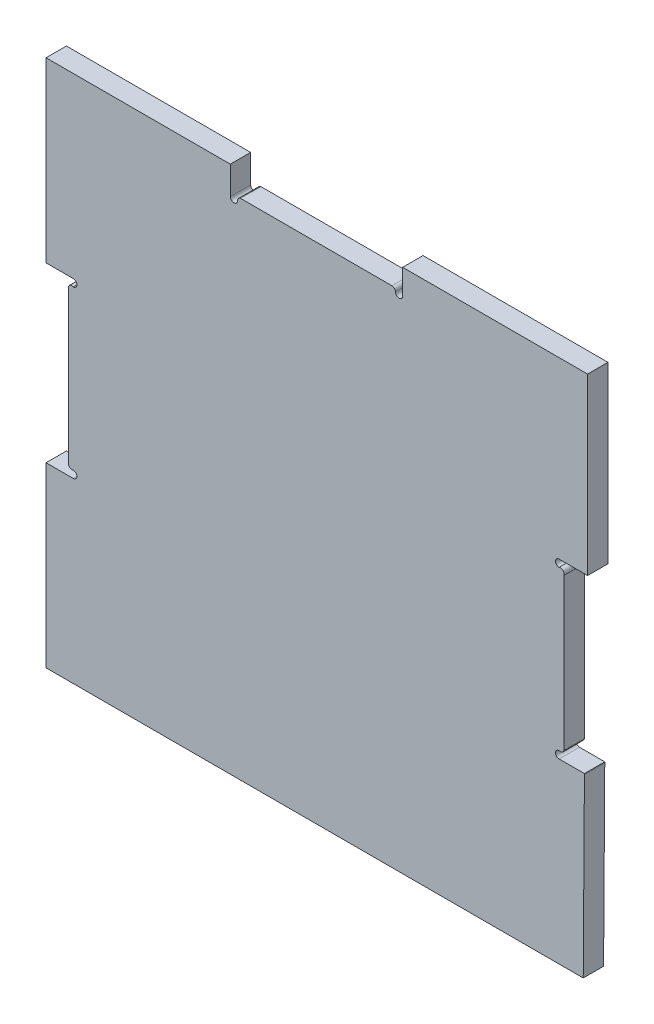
ISO-10303-21;
HEADER;
FILE_DESCRIPTION(('STEP AP214'),'2;1');
FILE_NAME('part.step','',(''),(''),'','','');
FILE_SCHEMA(('AUTOMOTIVE_DESIGN { 1 0 10303 214 1 1 1 1 }'));
ENDSEC;
DATA;
#1=APPLICATION_CONTEXT('core data for automotive mechanical design processes');
#2=APPLICATION_PROTOCOL_DEFINITION('international standard','automotive_design',2000,#1);
#3=PRODUCT_CONTEXT('',#1,'mechanical');
#4=PRODUCT('Part','Part','',(#3));
#5=PRODUCT_RELATED_PRODUCT_CATEGORY('part','',(#4));
#6=PRODUCT_DEFINITION_FORMATION('','',#4);
#7=PRODUCT_DEFINITION_CONTEXT('part definition',#1,'design');
#8=PRODUCT_DEFINITION('design','',#6,#7);
#9=PRODUCT_DEFINITION_SHAPE('','',#8);
#10=(LENGTH_UNIT() NAMED_UNIT(*) SI_UNIT(.MILLI.,.METRE.));
#11=(NAMED_UNIT(*) PLANE_ANGLE_UNIT() SI_UNIT($,.RADIAN.));
#12=(NAMED_UNIT(*) SI_UNIT($,.STERADIAN.) SOLID_ANGLE_UNIT());
#13=UNCERTAINTY_MEASURE_WITH_UNIT(LENGTH_MEASURE(1.E-05),#10,'distance_accuracy_value','');
#14=(GEOMETRIC_REPRESENTATION_CONTEXT(3) GLOBAL_UNCERTAINTY_ASSIGNED_CONTEXT((#13)) GLOBAL_UNIT_ASSIGNED_CONTEXT((#10,
#11,#12)) REPRESENTATION_CONTEXT('',''));
#15=CARTESIAN_POINT('',(0.,0.,0.));
#16=DIRECTION('',(0.,0.,1.));
#17=DIRECTION('',(1.,0.,0.));
#18=AXIS2_PLACEMENT_3D('',#15,#16,#17);
#19=CARTESIAN_POINT('',(204.950295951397,1.47353347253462,17.));
#20=DIRECTION('',(-1.,0.,0.));
#21=DIRECTION('',(0.,0.,1.));
#22=AXIS2_PLACEMENT_3D('',#19,#20,#21);
#23=PLANE('',#22);
#24=DIRECTION('',(0.,1.,0.));
#25=VECTOR('',#24,1.);
#26=CARTESIAN_POINT('',(204.950295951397,1.47353347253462,0.));
#27=LINE('',#26,#25);
#28=CARTESIAN_POINT('',(204.950295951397,1.47353347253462,0.));
#29=VERTEX_POINT('',#28);
#30=CARTESIAN_POINT('',(204.950295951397,2.27000204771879,0.));
#31=VERTEX_POINT('',#30);
#32=EDGE_CURVE('E255',#29,#31,#27,.T.);
#33=ORIENTED_EDGE('',*,*,#32,.T.);
#34=DIRECTION('',(0.,0.,-1.));
#35=VECTOR('',#34,1.);
#36=CARTESIAN_POINT('',(204.950295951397,2.27000204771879,17.));
#37=LINE('',#36,#35);
#38=CARTESIAN_POINT('',(204.950295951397,2.27000204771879,17.));
#39=VERTEX_POINT('',#38);
#40=EDGE_CURVE('E11',#39,#31,#37,.T.);
#41=ORIENTED_EDGE('',*,*,#40,.F.);
#42=DIRECTION('',(0.,1.,0.));
#43=VECTOR('',#42,1.);
#44=CARTESIAN_POINT('',(204.950295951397,1.47353347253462,17.));
#45=LINE('',#44,#43);
#46=CARTESIAN_POINT('',(204.950295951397,1.47353347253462,17.));
#47=VERTEX_POINT('',#46);
#48=EDGE_CURVE('E312',#47,#39,#45,.T.);
#49=ORIENTED_EDGE('',*,*,#48,.F.);
#50=DIRECTION('',(0.,0.,-1.));
#51=VECTOR('',#50,1.);
#52=CARTESIAN_POINT('',(204.950295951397,1.47353347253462,17.));
#53=LINE('',#52,#51);
#54=EDGE_CURVE('E251',#47,#29,#53,.T.);
#55=ORIENTED_EDGE('',*,*,#54,.T.);
#56=EDGE_LOOP('',(#33,#41,#49,#55));
#57=FACE_BOUND('',#56,.T.);
#58=ADVANCED_FACE('F33',(#57),#23,.F.);
#59=CARTESIAN_POINT('',(183.801380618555,2.27000204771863,17.));
#60=DIRECTION('',(0.,-1.,0.));
#61=DIRECTION('',(1.,0.,0.));
#62=AXIS2_PLACEMENT_3D('',#59,#60,#61);
#63=PLANE('',#62);
#64=DIRECTION('',(-1.,0.,0.));
#65=VECTOR('',#64,1.);
#66=CARTESIAN_POINT('',(183.801380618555,2.27000204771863,0.));
#67=LINE('',#66,#65);
#68=CARTESIAN_POINT('',(183.801380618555,2.27000204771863,0.));
#69=VERTEX_POINT('',#68);
#70=EDGE_CURVE('E258',#31,#69,#67,.T.);
#71=ORIENTED_EDGE('',*,*,#70,.T.);
#72=DIRECTION('',(0.,0.,-1.));
#73=VECTOR('',#72,1.);
#74=CARTESIAN_POINT('',(183.801380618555,2.27000204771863,17.));
#75=LINE('',#74,#73);
#76=CARTESIAN_POINT('',(183.801380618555,2.27000204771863,17.));
#77=VERTEX_POINT('',#76);
#78=EDGE_CURVE('E41',#77,#69,#75,.T.);
#79=ORIENTED_EDGE('',*,*,#78,.F.);
#80=DIRECTION('',(-1.,0.,0.));
#81=VECTOR('',#80,1.);
#82=CARTESIAN_POINT('',(183.801380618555,2.27000204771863,17.));
#83=LINE('',#82,#81);
#84=EDGE_CURVE('E155',#39,#77,#83,.T.);
#85=ORIENTED_EDGE('',*,*,#84,.F.);
#86=ORIENTED_EDGE('',*,*,#40,.T.);
#87=EDGE_LOOP('',(#71,#79,#85,#86));
#88=FACE_BOUND('',#87,.T.);
#89=ADVANCED_FACE('F475',(#88),#63,.F.);
#90=CARTESIAN_POINT('',(183.801380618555,5.27000204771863,17.));
#91=DIRECTION('',(0.,0.,-1.));
#92=DIRECTION('',(-1.,0.,0.));
#93=AXIS2_PLACEMENT_3D('',#90,#91,#92);
#94=CYLINDRICAL_SURFACE('',#93,3.);
#95=CARTESIAN_POINT('',(183.801380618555,5.27000204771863,0.));
#96=DIRECTION('',(0.,0.,-1.));
#97=DIRECTION('',(-1.,0.,0.));
#98=AXIS2_PLACEMENT_3D('',#95,#96,#97);
#99=CIRCLE('',#98,3.);
#100=CARTESIAN_POINT('',(183.801380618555,8.27000204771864,0.));
#101=VERTEX_POINT('',#100);
#102=EDGE_CURVE('E260',#69,#101,#99,.T.);
#103=ORIENTED_EDGE('',*,*,#102,.T.);
#104=DIRECTION('',(0.,0.,-1.));
#105=VECTOR('',#104,1.);
#106=CARTESIAN_POINT('',(183.801380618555,8.27000204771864,17.));
#107=LINE('',#106,#105);
#108=CARTESIAN_POINT('',(183.801380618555,8.27000204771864,17.));
#109=VERTEX_POINT('',#108);
#110=EDGE_CURVE('E382',#109,#101,#107,.T.);
#111=ORIENTED_EDGE('',*,*,#110,.F.);
#112=CARTESIAN_POINT('',(183.801380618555,5.27000204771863,17.));
#113=DIRECTION('',(0.,0.,-1.));
#114=DIRECTION('',(-1.,0.,0.));
#115=AXIS2_PLACEMENT_3D('',#112,#113,#114);
#116=CIRCLE('',#115,3.);
#117=EDGE_CURVE('E390',#77,#109,#116,.T.);
#118=ORIENTED_EDGE('',*,*,#117,.F.);
#119=ORIENTED_EDGE('',*,*,#78,.T.);
#120=EDGE_LOOP('',(#103,#111,#118,#119));
#121=FACE_BOUND('',#120,.T.);
#122=ADVANCED_FACE('F388',(#121),#94,.F.);
#123=CARTESIAN_POINT('',(184.900704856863,11.0613254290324,17.));
#124=DIRECTION('',(0.,0.,-1.));
#125=DIRECTION('',(-1.,0.,0.));
#126=AXIS2_PLACEMENT_3D('',#123,#124,#125);
#127=CYLINDRICAL_SURFACE('',#126,3.00000000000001);
#128=CARTESIAN_POINT('',(184.900704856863,11.0613254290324,0.));
#129=DIRECTION('',(0.,0.,1.));
#130=DIRECTION('',(-1.,0.,0.));
#131=AXIS2_PLACEMENT_3D('',#128,#129,#130);
#132=CIRCLE('',#131,3.00000000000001);
#133=CARTESIAN_POINT('',(187.855837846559,10.5444221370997,0.));
#134=VERTEX_POINT('',#133);
#135=EDGE_CURVE('E262',#101,#134,#132,.T.);
#136=ORIENTED_EDGE('',*,*,#135,.T.);
#137=DIRECTION('',(0.,0.,-1.));
#138=VECTOR('',#137,1.);
#139=CARTESIAN_POINT('',(187.855837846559,10.5444221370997,17.));
#140=LINE('',#139,#138);
#141=CARTESIAN_POINT('',(187.855837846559,10.5444221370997,17.));
#142=VERTEX_POINT('',#141);
#143=EDGE_CURVE('E379',#142,#134,#140,.T.);
#144=ORIENTED_EDGE('',*,*,#143,.F.);
#145=CARTESIAN_POINT('',(184.900704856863,11.0613254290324,17.));
#146=DIRECTION('',(0.,0.,1.));
#147=DIRECTION('',(-1.,0.,0.));
#148=AXIS2_PLACEMENT_3D('',#145,#146,#147);
#149=CIRCLE('',#148,3.00000000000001);
#150=EDGE_CURVE('E408',#109,#142,#149,.T.);
#151=ORIENTED_EDGE('',*,*,#150,.F.);
#152=ORIENTED_EDGE('',*,*,#110,.T.);
#153=EDGE_LOOP('',(#136,#144,#151,#152));
#154=FACE_BOUND('',#153,.T.);
#155=ADVANCED_FACE('F399',(#154),#127,.T.);
#156=CARTESIAN_POINT('',(187.855837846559,137.104422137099,17.));
#157=DIRECTION('',(-1.,0.,0.));
#158=DIRECTION('',(0.,-1.,0.));
#159=AXIS2_PLACEMENT_3D('',#156,#157,#158);
#160=PLANE('',#159);
#161=DIRECTION('',(0.,1.,0.));
#162=VECTOR('',#161,1.);
#163=CARTESIAN_POINT('',(187.855837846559,137.104422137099,0.));
#164=LINE('',#163,#162);
#165=CARTESIAN_POINT('',(187.855837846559,137.104422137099,0.));
#166=VERTEX_POINT('',#165);
#167=EDGE_CURVE('E264',#134,#166,#164,.T.);
#168=ORIENTED_EDGE('',*,*,#167,.T.);
#169=DIRECTION('',(0.,0.,-1.));
#170=VECTOR('',#169,1.);
#171=CARTESIAN_POINT('',(187.855837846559,137.104422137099,17.));
#172=LINE('',#171,#170);
#173=CARTESIAN_POINT('',(187.855837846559,137.104422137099,17.));
#174=VERTEX_POINT('',#173);
#175=EDGE_CURVE('E376',#174,#166,#172,.T.);
#176=ORIENTED_EDGE('',*,*,#175,.F.);
#177=DIRECTION('',(0.,1.,0.));
#178=VECTOR('',#177,1.);
#179=CARTESIAN_POINT('',(187.855837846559,137.104422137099,17.));
#180=LINE('',#179,#178);
#181=EDGE_CURVE('E405',#142,#174,#180,.T.);
#182=ORIENTED_EDGE('',*,*,#181,.F.);
#183=ORIENTED_EDGE('',*,*,#143,.T.);
#184=EDGE_LOOP('',(#168,#176,#182,#183));
#185=FACE_BOUND('',#184,.T.);
#186=ADVANCED_FACE('F403',(#185),#160,.F.);
#187=CARTESIAN_POINT('',(185.022231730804,138.089651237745,17.));
#188=DIRECTION('',(0.,0.,-1.));
#189=DIRECTION('',(-1.,0.,0.));
#190=AXIS2_PLACEMENT_3D('',#187,#188,#189);
#191=CYLINDRICAL_SURFACE('',#190,3.);
#192=CARTESIAN_POINT('',(185.022231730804,138.089651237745,0.));
#193=DIRECTION('',(0.,0.,1.));
#194=DIRECTION('',(-1.,0.,0.));
#195=AXIS2_PLACEMENT_3D('',#192,#193,#194);
#196=CIRCLE('',#195,3.);
#197=CARTESIAN_POINT('',(183.801380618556,140.830002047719,0.));
#198=VERTEX_POINT('',#197);
#199=EDGE_CURVE('E266',#166,#198,#196,.T.);
#200=ORIENTED_EDGE('',*,*,#199,.T.);
#201=DIRECTION('',(0.,0.,-1.));
#202=VECTOR('',#201,1.);
#203=CARTESIAN_POINT('',(183.801380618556,140.830002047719,17.));
#204=LINE('',#203,#202);
#205=CARTESIAN_POINT('',(183.801380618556,140.830002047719,17.));
#206=VERTEX_POINT('',#205);
#207=EDGE_CURVE('E373',#206,#198,#204,.T.);
#208=ORIENTED_EDGE('',*,*,#207,.F.);
#209=CARTESIAN_POINT('',(185.022231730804,138.089651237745,17.));
#210=DIRECTION('',(0.,0.,1.));
#211=DIRECTION('',(-1.,0.,0.));
#212=AXIS2_PLACEMENT_3D('',#209,#210,#211);
#213=CIRCLE('',#212,3.);
#214=EDGE_CURVE('E407',#174,#206,#213,.T.);
#215=ORIENTED_EDGE('',*,*,#214,.F.);
#216=ORIENTED_EDGE('',*,*,#175,.T.);
#217=EDGE_LOOP('',(#200,#208,#215,#216));
#218=FACE_BOUND('',#217,.T.);
#219=ADVANCED_FACE('F488',(#218),#191,.T.);
#220=CARTESIAN_POINT('',(183.801380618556,143.830002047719,17.));
#221=DIRECTION('',(0.,0.,-1.));
#222=DIRECTION('',(-1.,0.,0.));
#223=AXIS2_PLACEMENT_3D('',#220,#221,#222);
#224=CYLINDRICAL_SURFACE('',#223,3.);
#225=CARTESIAN_POINT('',(183.801380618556,143.830002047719,0.));
#226=DIRECTION('',(0.,0.,-1.));
#227=DIRECTION('',(-1.,0.,0.));
#228=AXIS2_PLACEMENT_3D('',#225,#226,#227);
#229=CIRCLE('',#228,3.);
#230=CARTESIAN_POINT('',(183.801380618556,146.830002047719,0.));
#231=VERTEX_POINT('',#230);
#232=EDGE_CURVE('E268',#198,#231,#229,.T.);
#233=ORIENTED_EDGE('',*,*,#232,.T.);
#234=DIRECTION('',(0.,0.,-1.));
#235=VECTOR('',#234,1.);
#236=CARTESIAN_POINT('',(183.801380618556,146.830002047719,17.));
#237=LINE('',#236,#235);
#238=CARTESIAN_POINT('',(183.801380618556,146.830002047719,17.));
#239=VERTEX_POINT('',#238);
#240=EDGE_CURVE('E370',#239,#231,#237,.T.);
#241=ORIENTED_EDGE('',*,*,#240,.F.);
#242=CARTESIAN_POINT('',(183.801380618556,143.830002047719,17.));
#243=DIRECTION('',(0.,0.,-1.));
#244=DIRECTION('',(-1.,0.,0.));
#245=AXIS2_PLACEMENT_3D('',#242,#243,#244);
#246=CIRCLE('',#245,3.);
#247=EDGE_CURVE('E410',#206,#239,#246,.T.);
#248=ORIENTED_EDGE('',*,*,#247,.F.);
#249=ORIENTED_EDGE('',*,*,#207,.T.);
#250=EDGE_LOOP('',(#233,#241,#248,#249));
#251=FACE_BOUND('',#250,.T.);
#252=ADVANCED_FACE('F491',(#251),#224,.F.);
#253=CARTESIAN_POINT('',(206.554433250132,146.830002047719,17.));
#254=DIRECTION('',(0.,1.,0.));
#255=DIRECTION('',(-1.,0.,0.));
#256=AXIS2_PLACEMENT_3D('',#253,#254,#255);
#257=PLANE('',#256);
#258=DIRECTION('',(1.,0.,0.));
#259=VECTOR('',#258,1.);
#260=CARTESIAN_POINT('',(206.554433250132,146.830002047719,0.));
#261=LINE('',#260,#259);
#262=CARTESIAN_POINT('',(207.608890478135,146.830002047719,0.));
#263=VERTEX_POINT('',#262);
#264=EDGE_CURVE('E271',#231,#263,#261,.T.);
#265=ORIENTED_EDGE('',*,*,#264,.T.);
#266=DIRECTION('',(0.,0.,-1.));
#267=VECTOR('',#266,1.);
#268=CARTESIAN_POINT('',(207.608890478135,146.830002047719,17.));
#269=LINE('',#268,#267);
#270=CARTESIAN_POINT('',(207.608890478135,146.830002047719,17.));
#271=VERTEX_POINT('',#270);
#272=EDGE_CURVE('E367',#271,#263,#269,.T.);
#273=ORIENTED_EDGE('',*,*,#272,.F.);
#274=DIRECTION('',(1.,0.,0.));
#275=VECTOR('',#274,1.);
#276=CARTESIAN_POINT('',(206.554433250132,146.830002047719,17.));
#277=LINE('',#276,#275);
#278=EDGE_CURVE('E416',#239,#271,#277,.T.);
#279=ORIENTED_EDGE('',*,*,#278,.F.);
#280=ORIENTED_EDGE('',*,*,#240,.T.);
#281=EDGE_LOOP('',(#265,#273,#279,#280));
#282=FACE_BOUND('',#281,.T.);
#283=ADVANCED_FACE('F495',(#282),#257,.F.);
#284=CARTESIAN_POINT('',(207.608890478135,146.830002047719,17.));
#285=DIRECTION('',(-1.,0.,0.));
#286=DIRECTION('',(0.,-1.,0.));
#287=AXIS2_PLACEMENT_3D('',#284,#285,#286);
#288=PLANE('',#287);
#289=DIRECTION('',(0.,1.,0.));
#290=VECTOR('',#289,1.);
#291=CARTESIAN_POINT('',(207.608890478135,146.830002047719,0.));
#292=LINE('',#291,#290);
#293=CARTESIAN_POINT('',(207.608890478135,292.581053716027,0.));
#294=VERTEX_POINT('',#293);
#295=EDGE_CURVE('E273',#263,#294,#292,.T.);
#296=ORIENTED_EDGE('',*,*,#295,.T.);
#297=DIRECTION('',(0.,0.,-1.));
#298=VECTOR('',#297,1.);
#299=CARTESIAN_POINT('',(207.608890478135,292.581053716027,17.));
#300=LINE('',#299,#298);
#301=CARTESIAN_POINT('',(207.608890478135,292.581053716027,17.));
#302=VERTEX_POINT('',#301);
#303=EDGE_CURVE('E364',#302,#294,#300,.T.);
#304=ORIENTED_EDGE('',*,*,#303,.F.);
#305=DIRECTION('',(0.,1.,0.));
#306=VECTOR('',#305,1.);
#307=CARTESIAN_POINT('',(207.608890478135,146.830002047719,17.));
#308=LINE('',#307,#306);
#309=EDGE_CURVE('E418',#271,#302,#308,.T.);
#310=ORIENTED_EDGE('',*,*,#309,.F.);
#311=ORIENTED_EDGE('',*,*,#272,.T.);
#312=EDGE_LOOP('',(#296,#304,#310,#311));
#313=FACE_BOUND('',#312,.T.);
#314=ADVANCED_FACE('F499',(#313),#288,.F.);
#315=CARTESIAN_POINT('',(207.608890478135,292.581053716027,17.));
#316=DIRECTION('',(0.,-1.,0.));
#317=DIRECTION('',(1.,0.,0.));
#318=AXIS2_PLACEMENT_3D('',#315,#316,#317);
#319=PLANE('',#318);
#320=DIRECTION('',(-1.,0.,0.));
#321=VECTOR('',#320,1.);
#322=CARTESIAN_POINT('',(207.608890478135,292.581053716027,0.));
#323=LINE('',#322,#321);
#324=CARTESIAN_POINT('',(53.1252408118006,292.581053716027,0.));
#325=VERTEX_POINT('',#324);
#326=EDGE_CURVE('E275',#294,#325,#323,.T.);
#327=ORIENTED_EDGE('',*,*,#326,.T.);
#328=DIRECTION('',(0.,0.,-1.));
#329=VECTOR('',#328,1.);
#330=CARTESIAN_POINT('',(53.1252408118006,292.581053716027,17.));
#331=LINE('',#330,#329);
#332=CARTESIAN_POINT('',(53.1252408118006,292.581053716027,17.));
#333=VERTEX_POINT('',#332);
#334=EDGE_CURVE('E361',#333,#325,#331,.T.);
#335=ORIENTED_EDGE('',*,*,#334,.F.);
#336=DIRECTION('',(-1.,0.,0.));
#337=VECTOR('',#336,1.);
#338=CARTESIAN_POINT('',(207.608890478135,292.581053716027,17.));
#339=LINE('',#338,#337);
#340=EDGE_CURVE('E420',#302,#333,#339,.T.);
#341=ORIENTED_EDGE('',*,*,#340,.F.);
#342=ORIENTED_EDGE('',*,*,#303,.T.);
#343=EDGE_LOOP('',(#327,#335,#341,#342));
#344=FACE_BOUND('',#343,.T.);
#345=ADVANCED_FACE('F503',(#344),#319,.F.);
#346=CARTESIAN_POINT('',(53.1252408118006,292.581053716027,17.));
#347=DIRECTION('',(1.,0.,0.));
#348=DIRECTION('',(0.,0.,-1.));
#349=AXIS2_PLACEMENT_3D('',#346,#347,#348);
#350=PLANE('',#349);
#351=DIRECTION('',(0.,-1.,0.));
#352=VECTOR('',#351,1.);
#353=CARTESIAN_POINT('',(53.1252408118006,292.581053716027,0.));
#354=LINE('',#353,#352);
#355=CARTESIAN_POINT('',(53.1252408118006,271.740907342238,0.));
#356=VERTEX_POINT('',#355);
#357=EDGE_CURVE('E277',#325,#356,#354,.T.);
#358=ORIENTED_EDGE('',*,*,#357,.T.);
#359=DIRECTION('',(0.,0.,-1.));
#360=VECTOR('',#359,1.);
#361=CARTESIAN_POINT('',(53.1252408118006,271.740907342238,17.));
#362=LINE('',#361,#360);
#363=CARTESIAN_POINT('',(53.1252408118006,271.740907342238,17.));
#364=VERTEX_POINT('',#363);
#365=EDGE_CURVE('E358',#364,#356,#362,.T.);
#366=ORIENTED_EDGE('',*,*,#365,.F.);
#367=DIRECTION('',(0.,-1.,0.));
#368=VECTOR('',#367,1.);
#369=CARTESIAN_POINT('',(53.1252408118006,292.581053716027,17.));
#370=LINE('',#369,#368);
#371=EDGE_CURVE('E422',#333,#364,#370,.T.);
#372=ORIENTED_EDGE('',*,*,#371,.F.);
#373=ORIENTED_EDGE('',*,*,#334,.T.);
#374=EDGE_LOOP('',(#358,#366,#372,#373));
#375=FACE_BOUND('',#374,.T.);
#376=ADVANCED_FACE('F507',(#375),#350,.F.);
#377=CARTESIAN_POINT('',(50.1252408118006,271.740907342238,17.));
#378=DIRECTION('',(0.,0.,-1.));
#379=DIRECTION('',(-1.,0.,0.));
#380=AXIS2_PLACEMENT_3D('',#377,#378,#379);
#381=CYLINDRICAL_SURFACE('',#380,3.);
#382=CARTESIAN_POINT('',(50.1252408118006,271.740907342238,0.));
#383=DIRECTION('',(0.,0.,-1.));
#384=DIRECTION('',(1.,0.,0.));
#385=AXIS2_PLACEMENT_3D('',#382,#383,#384);
#386=CIRCLE('',#385,3.);
#387=CARTESIAN_POINT('',(47.1252408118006,271.740907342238,0.));
#388=VERTEX_POINT('',#387);
#389=EDGE_CURVE('E279',#356,#388,#386,.T.);
#390=ORIENTED_EDGE('',*,*,#389,.T.);
#391=DIRECTION('',(0.,0.,-1.));
#392=VECTOR('',#391,1.);
#393=CARTESIAN_POINT('',(47.1252408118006,271.740907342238,17.));
#394=LINE('',#393,#392);
#395=CARTESIAN_POINT('',(47.1252408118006,271.740907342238,17.));
#396=VERTEX_POINT('',#395);
#397=EDGE_CURVE('E355',#396,#388,#394,.T.);
#398=ORIENTED_EDGE('',*,*,#397,.F.);
#399=CARTESIAN_POINT('',(50.1252408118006,271.740907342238,17.));
#400=DIRECTION('',(0.,0.,-1.));
#401=DIRECTION('',(1.,0.,0.));
#402=AXIS2_PLACEMENT_3D('',#399,#400,#401);
#403=CIRCLE('',#402,3.);
#404=EDGE_CURVE('E424',#364,#396,#403,.T.);
#405=ORIENTED_EDGE('',*,*,#404,.F.);
#406=ORIENTED_EDGE('',*,*,#365,.T.);
#407=EDGE_LOOP('',(#390,#398,#405,#406));
#408=FACE_BOUND('',#407,.T.);
#409=ADVANCED_FACE('F511',(#408),#381,.F.);
#410=CARTESIAN_POINT('',(44.1252408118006,271.740907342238,17.));
#411=DIRECTION('',(0.,0.,-1.));
#412=DIRECTION('',(-1.,0.,0.));
#413=AXIS2_PLACEMENT_3D('',#410,#411,#412);
#414=CYLINDRICAL_SURFACE('',#413,2.99999999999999);
#415=CARTESIAN_POINT('',(44.1252408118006,271.740907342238,0.));
#416=DIRECTION('',(0.,0.,1.));
#417=DIRECTION('',(1.,0.,0.));
#418=AXIS2_PLACEMENT_3D('',#415,#416,#417);
#419=CIRCLE('',#418,2.99999999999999);
#420=CARTESIAN_POINT('',(44.1808378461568,274.740392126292,0.));
#421=VERTEX_POINT('',#420);
#422=EDGE_CURVE('E281',#388,#421,#419,.T.);
#423=ORIENTED_EDGE('',*,*,#422,.T.);
#424=DIRECTION('',(0.,0.,-1.));
#425=VECTOR('',#424,1.);
#426=CARTESIAN_POINT('',(44.1808378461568,274.740392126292,17.));
#427=LINE('',#426,#425);
#428=CARTESIAN_POINT('',(44.1808378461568,274.740392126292,17.));
#429=VERTEX_POINT('',#428);
#430=EDGE_CURVE('E352',#429,#421,#427,.T.);
#431=ORIENTED_EDGE('',*,*,#430,.F.);
#432=CARTESIAN_POINT('',(44.1252408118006,271.740907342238,17.));
#433=DIRECTION('',(0.,0.,1.));
#434=DIRECTION('',(1.,0.,0.));
#435=AXIS2_PLACEMENT_3D('',#432,#433,#434);
#436=CIRCLE('',#435,2.99999999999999);
#437=EDGE_CURVE('E426',#396,#429,#436,.T.);
#438=ORIENTED_EDGE('',*,*,#437,.F.);
#439=ORIENTED_EDGE('',*,*,#397,.T.);
#440=EDGE_LOOP('',(#423,#431,#438,#439));
#441=FACE_BOUND('',#440,.T.);
#442=ADVANCED_FACE('F515',(#441),#414,.T.);
#443=CARTESIAN_POINT('',(44.1808378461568,274.740392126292,17.));
#444=DIRECTION('',(-3.56402840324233E-06,-0.999999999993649,0.));
#445=DIRECTION('',(0.999999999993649,-3.56402840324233E-06,0.));
#446=AXIS2_PLACEMENT_3D('',#443,#444,#445);
#447=PLANE('',#446);
#448=DIRECTION('',(-0.999999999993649,3.56402840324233E-06,0.));
#449=VECTOR('',#448,1.);
#450=CARTESIAN_POINT('',(44.1808378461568,274.740392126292,0.));
#451=LINE('',#450,#449);
#452=CARTESIAN_POINT('',(-82.3791621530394,274.740843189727,0.));
#453=VERTEX_POINT('',#452);
#454=EDGE_CURVE('E283',#421,#453,#451,.T.);
#455=ORIENTED_EDGE('',*,*,#454,.T.);
#456=DIRECTION('',(0.,0.,-1.));
#457=VECTOR('',#456,1.);
#458=CARTESIAN_POINT('',(-82.3791621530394,274.740843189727,17.));
#459=LINE('',#458,#457);
#460=CARTESIAN_POINT('',(-82.3791621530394,274.740843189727,17.));
#461=VERTEX_POINT('',#460);
#462=EDGE_CURVE('E349',#461,#453,#459,.T.);
#463=ORIENTED_EDGE('',*,*,#462,.F.);
#464=DIRECTION('',(-0.999999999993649,3.56402840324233E-06,0.));
#465=VECTOR('',#464,1.);
#466=CARTESIAN_POINT('',(44.1808378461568,274.740392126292,17.));
#467=LINE('',#466,#465);
#468=EDGE_CURVE('E428',#429,#461,#467,.T.);
#469=ORIENTED_EDGE('',*,*,#468,.F.);
#470=ORIENTED_EDGE('',*,*,#430,.T.);
#471=EDGE_LOOP('',(#455,#463,#469,#470));
#472=FACE_BOUND('',#471,.T.);
#473=ADVANCED_FACE('F519',(#472),#447,.F.);
#474=CARTESIAN_POINT('',(-81.8245806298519,271.792548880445,17.));
#475=DIRECTION('',(0.,0.,-1.));
#476=DIRECTION('',(-1.,0.,0.));
#477=AXIS2_PLACEMENT_3D('',#474,#475,#476);
#478=CYLINDRICAL_SURFACE('',#477,3.00000000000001);
#479=CARTESIAN_POINT('',(-81.8245806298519,271.792548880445,0.));
#480=DIRECTION('',(0.,0.,1.));
#481=DIRECTION('',(1.,0.,0.));
#482=AXIS2_PLACEMENT_3D('',#479,#480,#481);
#483=CIRCLE('',#482,3.00000000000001);
#484=CARTESIAN_POINT('',(-84.8241350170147,271.740843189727,0.));
#485=VERTEX_POINT('',#484);
#486=EDGE_CURVE('E285',#453,#485,#483,.T.);
#487=ORIENTED_EDGE('',*,*,#486,.T.);
#488=DIRECTION('',(0.,0.,-1.));
#489=VECTOR('',#488,1.);
#490=CARTESIAN_POINT('',(-84.8241350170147,271.740843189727,17.));
#491=LINE('',#490,#489);
#492=CARTESIAN_POINT('',(-84.8241350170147,271.740843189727,17.));
#493=VERTEX_POINT('',#492);
#494=EDGE_CURVE('E346',#493,#485,#491,.T.);
#495=ORIENTED_EDGE('',*,*,#494,.F.);
#496=CARTESIAN_POINT('',(-81.8245806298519,271.792548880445,17.));
#497=DIRECTION('',(0.,0.,1.));
#498=DIRECTION('',(1.,0.,0.));
#499=AXIS2_PLACEMENT_3D('',#496,#497,#498);
#500=CIRCLE('',#499,3.00000000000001);
#501=EDGE_CURVE('E430',#461,#493,#500,.T.);
#502=ORIENTED_EDGE('',*,*,#501,.F.);
#503=ORIENTED_EDGE('',*,*,#462,.T.);
#504=EDGE_LOOP('',(#487,#495,#502,#503));
#505=FACE_BOUND('',#504,.T.);
#506=ADVANCED_FACE('F523',(#505),#478,.T.);
#507=CARTESIAN_POINT('',(-87.8241350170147,271.740843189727,17.));
#508=DIRECTION('',(0.,0.,-1.));
#509=DIRECTION('',(-1.,0.,0.));
#510=AXIS2_PLACEMENT_3D('',#507,#508,#509);
#511=CYLINDRICAL_SURFACE('',#510,3.);
#512=CARTESIAN_POINT('',(-87.8241350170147,271.740843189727,0.));
#513=DIRECTION('',(0.,0.,-1.));
#514=DIRECTION('',(1.,0.,0.));
#515=AXIS2_PLACEMENT_3D('',#512,#513,#514);
#516=CIRCLE('',#515,3.);
#517=CARTESIAN_POINT('',(-90.8241350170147,271.740843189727,0.));
#518=VERTEX_POINT('',#517);
#519=EDGE_CURVE('E287',#485,#518,#516,.T.);
#520=ORIENTED_EDGE('',*,*,#519,.T.);
#521=DIRECTION('',(0.,0.,-1.));
#522=VECTOR('',#521,1.);
#523=CARTESIAN_POINT('',(-90.8241350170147,271.740843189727,17.));
#524=LINE('',#523,#522);
#525=CARTESIAN_POINT('',(-90.8241350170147,271.740843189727,17.));
#526=VERTEX_POINT('',#525);
#527=EDGE_CURVE('E343',#526,#518,#524,.T.);
#528=ORIENTED_EDGE('',*,*,#527,.F.);
#529=CARTESIAN_POINT('',(-87.8241350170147,271.740843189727,17.));
#530=DIRECTION('',(0.,0.,-1.));
#531=DIRECTION('',(1.,0.,0.));
#532=AXIS2_PLACEMENT_3D('',#529,#530,#531);
#533=CIRCLE('',#532,3.);
#534=EDGE_CURVE('E432',#493,#526,#533,.T.);
#535=ORIENTED_EDGE('',*,*,#534,.F.);
#536=ORIENTED_EDGE('',*,*,#494,.T.);
#537=EDGE_LOOP('',(#520,#528,#535,#536));
#538=FACE_BOUND('',#537,.T.);
#539=ADVANCED_FACE('F527',(#538),#511,.F.);
#540=CARTESIAN_POINT('',(-90.8241350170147,271.740843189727,17.));
#541=DIRECTION('',(-1.,0.,0.));
#542=DIRECTION('',(0.,0.,1.));
#543=AXIS2_PLACEMENT_3D('',#540,#541,#542);
#544=PLANE('',#543);
#545=DIRECTION('',(0.,1.,0.));
#546=VECTOR('',#545,1.);
#547=CARTESIAN_POINT('',(-90.8241350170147,271.740843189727,0.));
#548=LINE('',#547,#546);
#549=CARTESIAN_POINT('',(-90.8241350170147,295.219475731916,0.));
#550=VERTEX_POINT('',#549);
#551=EDGE_CURVE('E289',#518,#550,#548,.T.);
#552=ORIENTED_EDGE('',*,*,#551,.T.);
#553=DIRECTION('',(0.,0.,-1.));
#554=VECTOR('',#553,1.);
#555=CARTESIAN_POINT('',(-90.8241350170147,295.219475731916,17.));
#556=LINE('',#555,#554);
#557=CARTESIAN_POINT('',(-90.8241350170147,295.219475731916,17.));
#558=VERTEX_POINT('',#557);
#559=EDGE_CURVE('E340',#558,#550,#556,.T.);
#560=ORIENTED_EDGE('',*,*,#559,.F.);
#561=DIRECTION('',(0.,1.,0.));
#562=VECTOR('',#561,1.);
#563=CARTESIAN_POINT('',(-90.8241350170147,271.740843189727,17.));
#564=LINE('',#563,#562);
#565=EDGE_CURVE('E434',#526,#558,#564,.T.);
#566=ORIENTED_EDGE('',*,*,#565,.F.);
#567=ORIENTED_EDGE('',*,*,#527,.T.);
#568=EDGE_LOOP('',(#552,#560,#566,#567));
#569=FACE_BOUND('',#568,.T.);
#570=ADVANCED_FACE('F531',(#569),#544,.F.);
#571=CARTESIAN_POINT('',(-90.8241350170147,295.219475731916,17.));
#572=DIRECTION('',(0.,-1.,0.));
#573=DIRECTION('',(0.,0.,-1.));
#574=AXIS2_PLACEMENT_3D('',#571,#572,#573);
#575=PLANE('',#574);
#576=DIRECTION('',(-1.,0.,0.));
#577=VECTOR('',#576,1.);
#578=CARTESIAN_POINT('',(-90.8241350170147,295.219475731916,0.));
#579=LINE('',#578,#577);
#580=CARTESIAN_POINT('',(-244.752757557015,295.219475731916,0.));
#581=VERTEX_POINT('',#580);
#582=EDGE_CURVE('E291',#550,#581,#579,.T.);
#583=ORIENTED_EDGE('',*,*,#582,.T.);
#584=DIRECTION('',(0.,0.,-1.));
#585=VECTOR('',#584,1.);
#586=CARTESIAN_POINT('',(-244.752757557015,295.219475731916,17.));
#587=LINE('',#586,#585);
#588=CARTESIAN_POINT('',(-244.752757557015,295.219475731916,17.));
#589=VERTEX_POINT('',#588);
#590=EDGE_CURVE('E337',#589,#581,#587,.T.);
#591=ORIENTED_EDGE('',*,*,#590,.F.);
#592=DIRECTION('',(-1.,0.,0.));
#593=VECTOR('',#592,1.);
#594=CARTESIAN_POINT('',(-90.8241350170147,295.219475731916,17.));
#595=LINE('',#594,#593);
#596=EDGE_CURVE('E436',#558,#589,#595,.T.);
#597=ORIENTED_EDGE('',*,*,#596,.F.);
#598=ORIENTED_EDGE('',*,*,#559,.T.);
#599=EDGE_LOOP('',(#583,#591,#597,#598));
#600=FACE_BOUND('',#599,.T.);
#601=ADVANCED_FACE('F535',(#600),#575,.F.);
#602=CARTESIAN_POINT('',(-244.752757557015,295.219475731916,17.));
#603=DIRECTION('',(1.,0.,0.));
#604=DIRECTION('',(0.,0.,-1.));
#605=AXIS2_PLACEMENT_3D('',#602,#603,#604);
#606=PLANE('',#605);
#607=DIRECTION('',(0.,-1.,0.));
#608=VECTOR('',#607,1.);
#609=CARTESIAN_POINT('',(-244.752757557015,295.219475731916,0.));
#610=LINE('',#609,#608);
#611=CARTESIAN_POINT('',(-244.752757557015,146.830002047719,0.));
#612=VERTEX_POINT('',#611);
#613=EDGE_CURVE('E293',#581,#612,#610,.T.);
#614=ORIENTED_EDGE('',*,*,#613,.T.);
#615=DIRECTION('',(0.,0.,-1.));
#616=VECTOR('',#615,1.);
#617=CARTESIAN_POINT('',(-244.752757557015,146.830002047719,17.));
#618=LINE('',#617,#616);
#619=CARTESIAN_POINT('',(-244.752757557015,146.830002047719,17.));
#620=VERTEX_POINT('',#619);
#621=EDGE_CURVE('E334',#620,#612,#618,.T.);
#622=ORIENTED_EDGE('',*,*,#621,.F.);
#623=DIRECTION('',(0.,-1.,0.));
#624=VECTOR('',#623,1.);
#625=CARTESIAN_POINT('',(-244.752757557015,295.219475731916,17.));
#626=LINE('',#625,#624);
#627=EDGE_CURVE('E438',#589,#620,#626,.T.);
#628=ORIENTED_EDGE('',*,*,#627,.F.);
#629=ORIENTED_EDGE('',*,*,#590,.T.);
#630=EDGE_LOOP('',(#614,#622,#628,#629));
#631=FACE_BOUND('',#630,.T.);
#632=ADVANCED_FACE('F539',(#631),#606,.F.);
#633=CARTESIAN_POINT('',(-244.752757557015,146.830002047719,17.));
#634=DIRECTION('',(0.,1.,0.));
#635=DIRECTION('',(0.,0.,1.));
#636=AXIS2_PLACEMENT_3D('',#633,#634,#635);
#637=PLANE('',#636);
#638=DIRECTION('',(1.,0.,0.));
#639=VECTOR('',#638,1.);
#640=CARTESIAN_POINT('',(-244.752757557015,146.830002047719,0.));
#641=LINE('',#640,#639);
#642=CARTESIAN_POINT('',(-221.999704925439,146.830002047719,0.));
#643=VERTEX_POINT('',#642);
#644=EDGE_CURVE('E295',#612,#643,#641,.T.);
#645=ORIENTED_EDGE('',*,*,#644,.T.);
#646=DIRECTION('',(0.,0.,-1.));
#647=VECTOR('',#646,1.);
#648=CARTESIAN_POINT('',(-221.999704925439,146.830002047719,17.));
#649=LINE('',#648,#647);
#650=CARTESIAN_POINT('',(-221.999704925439,146.830002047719,17.));
#651=VERTEX_POINT('',#650);
#652=EDGE_CURVE('E331',#651,#643,#649,.T.);
#653=ORIENTED_EDGE('',*,*,#652,.F.);
#654=DIRECTION('',(1.,0.,0.));
#655=VECTOR('',#654,1.);
#656=CARTESIAN_POINT('',(-244.752757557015,146.830002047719,17.));
#657=LINE('',#656,#655);
#658=EDGE_CURVE('E440',#620,#651,#657,.T.);
#659=ORIENTED_EDGE('',*,*,#658,.F.);
#660=ORIENTED_EDGE('',*,*,#621,.T.);
#661=EDGE_LOOP('',(#645,#653,#659,#660));
#662=FACE_BOUND('',#661,.T.);
#663=ADVANCED_FACE('F543',(#662),#637,.F.);
#664=CARTESIAN_POINT('',(-221.999704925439,143.830002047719,17.));
#665=DIRECTION('',(0.,0.,-1.));
#666=DIRECTION('',(-1.,0.,0.));
#667=AXIS2_PLACEMENT_3D('',#664,#665,#666);
#668=CYLINDRICAL_SURFACE('',#667,3.);
#669=CARTESIAN_POINT('',(-221.999704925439,143.830002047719,0.));
#670=DIRECTION('',(0.,0.,-1.));
#671=DIRECTION('',(1.,0.,0.));
#672=AXIS2_PLACEMENT_3D('',#669,#670,#671);
#673=CIRCLE('',#672,3.);
#674=CARTESIAN_POINT('',(-221.999704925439,140.830002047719,0.));
#675=VERTEX_POINT('',#674);
#676=EDGE_CURVE('E297',#643,#675,#673,.T.);
#677=ORIENTED_EDGE('',*,*,#676,.T.);
#678=DIRECTION('',(0.,0.,-1.));
#679=VECTOR('',#678,1.);
#680=CARTESIAN_POINT('',(-221.999704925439,140.830002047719,17.));
#681=LINE('',#680,#679);
#682=CARTESIAN_POINT('',(-221.999704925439,140.830002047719,17.));
#683=VERTEX_POINT('',#682);
#684=EDGE_CURVE('E328',#683,#675,#681,.T.);
#685=ORIENTED_EDGE('',*,*,#684,.F.);
#686=CARTESIAN_POINT('',(-221.999704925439,143.830002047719,17.));
#687=DIRECTION('',(0.,0.,-1.));
#688=DIRECTION('',(1.,0.,0.));
#689=AXIS2_PLACEMENT_3D('',#686,#687,#688);
#690=CIRCLE('',#689,3.);
#691=EDGE_CURVE('E442',#651,#683,#690,.T.);
#692=ORIENTED_EDGE('',*,*,#691,.F.);
#693=ORIENTED_EDGE('',*,*,#652,.T.);
#694=EDGE_LOOP('',(#677,#685,#692,#693));
#695=FACE_BOUND('',#694,.T.);
#696=ADVANCED_FACE('F547',(#695),#668,.F.);
#697=CARTESIAN_POINT('',(-223.220556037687,138.089651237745,17.));
#698=DIRECTION('',(0.,0.,-1.));
#699=DIRECTION('',(-1.,0.,0.));
#700=AXIS2_PLACEMENT_3D('',#697,#698,#699);
#701=CYLINDRICAL_SURFACE('',#700,2.99999999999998);
#702=CARTESIAN_POINT('',(-223.220556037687,138.089651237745,0.));
#703=DIRECTION('',(0.,0.,1.));
#704=DIRECTION('',(1.,0.,0.));
#705=AXIS2_PLACEMENT_3D('',#702,#703,#704);
#706=CIRCLE('',#705,2.99999999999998);
#707=CARTESIAN_POINT('',(-226.054162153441,137.104422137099,0.));
#708=VERTEX_POINT('',#707);
#709=EDGE_CURVE('E299',#675,#708,#706,.T.);
#710=ORIENTED_EDGE('',*,*,#709,.T.);
#711=DIRECTION('',(0.,0.,-1.));
#712=VECTOR('',#711,1.);
#713=CARTESIAN_POINT('',(-226.054162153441,137.104422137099,17.));
#714=LINE('',#713,#712);
#715=CARTESIAN_POINT('',(-226.054162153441,137.104422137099,17.));
#716=VERTEX_POINT('',#715);
#717=EDGE_CURVE('E325',#716,#708,#714,.T.);
#718=ORIENTED_EDGE('',*,*,#717,.F.);
#719=CARTESIAN_POINT('',(-223.220556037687,138.089651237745,17.));
#720=DIRECTION('',(0.,0.,1.));
#721=DIRECTION('',(1.,0.,0.));
#722=AXIS2_PLACEMENT_3D('',#719,#720,#721);
#723=CIRCLE('',#722,2.99999999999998);
#724=EDGE_CURVE('E444',#683,#716,#723,.T.);
#725=ORIENTED_EDGE('',*,*,#724,.F.);
#726=ORIENTED_EDGE('',*,*,#684,.T.);
#727=EDGE_LOOP('',(#710,#718,#725,#726));
#728=FACE_BOUND('',#727,.T.);
#729=ADVANCED_FACE('F551',(#728),#701,.T.);
#730=CARTESIAN_POINT('',(-226.054162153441,137.104422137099,17.));
#731=DIRECTION('',(1.,0.,0.));
#732=DIRECTION('',(0.,0.,-1.));
#733=AXIS2_PLACEMENT_3D('',#730,#731,#732);
#734=PLANE('',#733);
#735=DIRECTION('',(0.,-1.,0.));
#736=VECTOR('',#735,1.);
#737=CARTESIAN_POINT('',(-226.054162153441,137.104422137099,0.));
#738=LINE('',#737,#736);
#739=CARTESIAN_POINT('',(-226.054162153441,10.5444221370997,0.));
#740=VERTEX_POINT('',#739);
#741=EDGE_CURVE('E301',#708,#740,#738,.T.);
#742=ORIENTED_EDGE('',*,*,#741,.T.);
#743=DIRECTION('',(0.,0.,-1.));
#744=VECTOR('',#743,1.);
#745=CARTESIAN_POINT('',(-226.054162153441,10.5444221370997,17.));
#746=LINE('',#745,#744);
#747=CARTESIAN_POINT('',(-226.054162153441,10.5444221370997,17.));
#748=VERTEX_POINT('',#747);
#749=EDGE_CURVE('E322',#748,#740,#746,.T.);
#750=ORIENTED_EDGE('',*,*,#749,.F.);
#751=DIRECTION('',(0.,-1.,0.));
#752=VECTOR('',#751,1.);
#753=CARTESIAN_POINT('',(-226.054162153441,137.104422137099,17.));
#754=LINE('',#753,#752);
#755=EDGE_CURVE('E446',#716,#748,#754,.T.);
#756=ORIENTED_EDGE('',*,*,#755,.F.);
#757=ORIENTED_EDGE('',*,*,#717,.T.);
#758=EDGE_LOOP('',(#742,#750,#756,#757));
#759=FACE_BOUND('',#758,.T.);
#760=ADVANCED_FACE('F555',(#759),#734,.F.);
#761=CARTESIAN_POINT('',(-223.099029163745,11.0613254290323,17.));
#762=DIRECTION('',(0.,0.,-1.));
#763=DIRECTION('',(-1.,0.,0.));
#764=AXIS2_PLACEMENT_3D('',#761,#762,#763);
#765=CYLINDRICAL_SURFACE('',#764,3.00000000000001);
#766=CARTESIAN_POINT('',(-223.099029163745,11.0613254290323,0.));
#767=DIRECTION('',(0.,0.,1.));
#768=DIRECTION('',(1.,0.,0.));
#769=AXIS2_PLACEMENT_3D('',#766,#767,#768);
#770=CIRCLE('',#769,3.00000000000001);
#771=CARTESIAN_POINT('',(-221.999704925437,8.27000204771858,0.));
#772=VERTEX_POINT('',#771);
#773=EDGE_CURVE('E303',#740,#772,#770,.T.);
#774=ORIENTED_EDGE('',*,*,#773,.T.);
#775=DIRECTION('',(0.,0.,-1.));
#776=VECTOR('',#775,1.);
#777=CARTESIAN_POINT('',(-221.999704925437,8.27000204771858,17.));
#778=LINE('',#777,#776);
#779=CARTESIAN_POINT('',(-221.999704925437,8.27000204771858,17.));
#780=VERTEX_POINT('',#779);
#781=EDGE_CURVE('E319',#780,#772,#778,.T.);
#782=ORIENTED_EDGE('',*,*,#781,.F.);
#783=CARTESIAN_POINT('',(-223.099029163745,11.0613254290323,17.));
#784=DIRECTION('',(0.,0.,1.));
#785=DIRECTION('',(1.,0.,0.));
#786=AXIS2_PLACEMENT_3D('',#783,#784,#785);
#787=CIRCLE('',#786,3.00000000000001);
#788=EDGE_CURVE('E448',#748,#780,#787,.T.);
#789=ORIENTED_EDGE('',*,*,#788,.F.);
#790=ORIENTED_EDGE('',*,*,#749,.T.);
#791=EDGE_LOOP('',(#774,#782,#789,#790));
#792=FACE_BOUND('',#791,.T.);
#793=ADVANCED_FACE('F559',(#792),#765,.T.);
#794=CARTESIAN_POINT('',(-221.999704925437,5.27000204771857,17.));
#795=DIRECTION('',(0.,0.,-1.));
#796=DIRECTION('',(-1.,0.,0.));
#797=AXIS2_PLACEMENT_3D('',#794,#795,#796);
#798=CYLINDRICAL_SURFACE('',#797,3.);
#799=CARTESIAN_POINT('',(-221.999704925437,5.27000204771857,0.));
#800=DIRECTION('',(0.,0.,-1.));
#801=DIRECTION('',(1.,0.,0.));
#802=AXIS2_PLACEMENT_3D('',#799,#800,#801);
#803=CIRCLE('',#802,3.);
#804=CARTESIAN_POINT('',(-221.999704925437,2.27000204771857,0.));
#805=VERTEX_POINT('',#804);
#806=EDGE_CURVE('E305',#772,#805,#803,.T.);
#807=ORIENTED_EDGE('',*,*,#806,.T.);
#808=DIRECTION('',(0.,0.,-1.));
#809=VECTOR('',#808,1.);
#810=CARTESIAN_POINT('',(-221.999704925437,2.27000204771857,17.));
#811=LINE('',#810,#809);
#812=CARTESIAN_POINT('',(-221.999704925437,2.27000204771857,17.));
#813=VERTEX_POINT('',#812);
#814=EDGE_CURVE('E316',#813,#805,#811,.T.);
#815=ORIENTED_EDGE('',*,*,#814,.F.);
#816=CARTESIAN_POINT('',(-221.999704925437,5.27000204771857,17.));
#817=DIRECTION('',(0.,0.,-1.));
#818=DIRECTION('',(1.,0.,0.));
#819=AXIS2_PLACEMENT_3D('',#816,#817,#818);
#820=CIRCLE('',#819,3.);
#821=EDGE_CURVE('E450',#780,#813,#820,.T.);
#822=ORIENTED_EDGE('',*,*,#821,.F.);
#823=ORIENTED_EDGE('',*,*,#781,.T.);
#824=EDGE_LOOP('',(#807,#815,#822,#823));
#825=FACE_BOUND('',#824,.T.);
#826=ADVANCED_FACE('F456',(#825),#798,.F.);
#827=CARTESIAN_POINT('',(-221.999704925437,2.27000204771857,17.));
#828=DIRECTION('',(0.,-1.,0.));
#829=DIRECTION('',(0.,0.,-1.));
#830=AXIS2_PLACEMENT_3D('',#827,#828,#829);
#831=PLANE('',#830);
#832=DIRECTION('',(-1.,0.,0.));
#833=VECTOR('',#832,1.);
#834=CARTESIAN_POINT('',(-221.999704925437,2.27000204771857,0.));
#835=LINE('',#834,#833);
#836=CARTESIAN_POINT('',(-244.752757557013,2.27000204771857,0.));
#837=VERTEX_POINT('',#836);
#838=EDGE_CURVE('E307',#805,#837,#835,.T.);
#839=ORIENTED_EDGE('',*,*,#838,.T.);
#840=DIRECTION('',(0.,0.,-1.));
#841=VECTOR('',#840,1.);
#842=CARTESIAN_POINT('',(-244.752757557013,2.27000204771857,17.));
#843=LINE('',#842,#841);
#844=CARTESIAN_POINT('',(-244.752757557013,2.27000204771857,17.));
#845=VERTEX_POINT('',#844);
#846=EDGE_CURVE('E246',#845,#837,#843,.T.);
#847=ORIENTED_EDGE('',*,*,#846,.F.);
#848=DIRECTION('',(-1.,0.,0.));
#849=VECTOR('',#848,1.);
#850=CARTESIAN_POINT('',(-221.999704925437,2.27000204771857,17.));
#851=LINE('',#850,#849);
#852=EDGE_CURVE('E237',#813,#845,#851,.T.);
#853=ORIENTED_EDGE('',*,*,#852,.F.);
#854=ORIENTED_EDGE('',*,*,#814,.T.);
#855=EDGE_LOOP('',(#839,#847,#853,#854));
#856=FACE_BOUND('',#855,.T.);
#857=ADVANCED_FACE('F460',(#856),#831,.F.);
#858=CARTESIAN_POINT('',(-244.752757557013,2.27000204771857,17.));
#859=DIRECTION('',(1.,0.,0.));
#860=DIRECTION('',(0.,0.,-1.));
#861=AXIS2_PLACEMENT_3D('',#858,#859,#860);
#862=PLANE('',#861);
#863=DIRECTION('',(0.,-1.,0.));
#864=VECTOR('',#863,1.);
#865=CARTESIAN_POINT('',(-244.752757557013,2.27000204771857,0.));
#866=LINE('',#865,#864);
#867=CARTESIAN_POINT('',(-244.752757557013,-146.119471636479,0.));
#868=VERTEX_POINT('',#867);
#869=EDGE_CURVE('E245',#837,#868,#866,.T.);
#870=ORIENTED_EDGE('',*,*,#869,.T.);
#871=DIRECTION('',(0.,0.,-1.));
#872=VECTOR('',#871,1.);
#873=CARTESIAN_POINT('',(-244.752757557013,-146.119471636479,17.));
#874=LINE('',#873,#872);
#875=CARTESIAN_POINT('',(-244.752757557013,-146.119471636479,17.));
#876=VERTEX_POINT('',#875);
#877=EDGE_CURVE('E242',#876,#868,#874,.T.);
#878=ORIENTED_EDGE('',*,*,#877,.F.);
#879=DIRECTION('',(0.,-1.,0.));
#880=VECTOR('',#879,1.);
#881=CARTESIAN_POINT('',(-244.752757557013,2.27000204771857,17.));
#882=LINE('',#881,#880);
#883=EDGE_CURVE('E231',#845,#876,#882,.T.);
#884=ORIENTED_EDGE('',*,*,#883,.F.);
#885=ORIENTED_EDGE('',*,*,#846,.T.);
#886=EDGE_LOOP('',(#870,#878,#884,#885));
#887=FACE_BOUND('',#886,.T.);
#888=ADVANCED_FACE('F243',(#887),#862,.F.);
#889=CARTESIAN_POINT('',(-244.752757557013,-146.119471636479,17.));
#890=DIRECTION('',(-7.50944138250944E-06,0.999999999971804,0.));
#891=DIRECTION('',(-0.999999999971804,-7.50944138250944E-06,0.));
#892=AXIS2_PLACEMENT_3D('',#889,#890,#891);
#893=PLANE('',#892);
#894=DIRECTION('',(0.999999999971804,7.50944138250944E-06,0.));
#895=VECTOR('',#894,1.);
#896=CARTESIAN_POINT('',(-244.752757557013,-146.119471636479,0.));
#897=LINE('',#896,#895);
#898=CARTESIAN_POINT('',(203.955663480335,-146.116102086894,0.));
#899=VERTEX_POINT('',#898);
#900=EDGE_CURVE('E141',#868,#899,#897,.T.);
#901=ORIENTED_EDGE('',*,*,#900,.T.);
#902=DIRECTION('',(0.,0.,-1.));
#903=VECTOR('',#902,1.);
#904=CARTESIAN_POINT('',(203.955663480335,-146.116102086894,17.));
#905=LINE('',#904,#903);
#906=CARTESIAN_POINT('',(203.955663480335,-146.116102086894,17.));
#907=VERTEX_POINT('',#906);
#908=EDGE_CURVE('E247',#907,#899,#905,.T.);
#909=ORIENTED_EDGE('',*,*,#908,.F.);
#910=DIRECTION('',(0.999999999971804,7.50944138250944E-06,0.));
#911=VECTOR('',#910,1.);
#912=CARTESIAN_POINT('',(-244.752757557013,-146.119471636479,17.));
#913=LINE('',#912,#911);
#914=EDGE_CURVE('E235',#876,#907,#913,.T.);
#915=ORIENTED_EDGE('',*,*,#914,.F.);
#916=ORIENTED_EDGE('',*,*,#877,.T.);
#917=EDGE_LOOP('',(#901,#909,#915,#916));
#918=FACE_BOUND('',#917,.T.);
#919=ADVANCED_FACE('F249',(#918),#893,.F.);
#920=CARTESIAN_POINT('',(203.955663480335,-146.116102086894,17.));
#921=DIRECTION('',(-0.999977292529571,0.00673902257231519,0.));
#922=DIRECTION('',(-0.00673902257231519,-0.99997729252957,0.));
#923=AXIS2_PLACEMENT_3D('',#920,#921,#922);
#924=PLANE('',#923);
#925=DIRECTION('',(0.00673902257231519,0.99997729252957,0.));
#926=VECTOR('',#925,1.);
#927=CARTESIAN_POINT('',(203.955663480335,-146.116102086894,0.));
#928=LINE('',#927,#926);
#929=EDGE_CURVE('E147',#899,#29,#928,.T.);
#930=ORIENTED_EDGE('',*,*,#929,.T.);
#931=ORIENTED_EDGE('',*,*,#54,.F.);
#932=DIRECTION('',(0.00673902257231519,0.99997729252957,0.));
#933=VECTOR('',#932,1.);
#934=CARTESIAN_POINT('',(203.955663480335,-146.116102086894,17.));
#935=LINE('',#934,#933);
#936=EDGE_CURVE('E49',#907,#47,#935,.T.);
#937=ORIENTED_EDGE('',*,*,#936,.F.);
#938=ORIENTED_EDGE('',*,*,#908,.T.);
#939=EDGE_LOOP('',(#930,#931,#937,#938));
#940=FACE_BOUND('',#939,.T.);
#941=ADVANCED_FACE('F464',(#940),#924,.F.);
#942=CARTESIAN_POINT('',(183.801380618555,5.27000204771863,17.));
#943=DIRECTION('',(0.,0.,-1.));
#944=DIRECTION('',(-1.,0.,0.));
#945=AXIS2_PLACEMENT_3D('',#942,#943,#944);
#946=PLANE('',#945);
#947=ORIENTED_EDGE('',*,*,#48,.T.);
#948=ORIENTED_EDGE('',*,*,#84,.T.);
#949=ORIENTED_EDGE('',*,*,#117,.T.);
#950=ORIENTED_EDGE('',*,*,#150,.T.);
#951=ORIENTED_EDGE('',*,*,#181,.T.);
#952=ORIENTED_EDGE('',*,*,#214,.T.);
#953=ORIENTED_EDGE('',*,*,#247,.T.);
#954=ORIENTED_EDGE('',*,*,#278,.T.);
#955=ORIENTED_EDGE('',*,*,#309,.T.);
#956=ORIENTED_EDGE('',*,*,#340,.T.);
#957=ORIENTED_EDGE('',*,*,#371,.T.);
#958=ORIENTED_EDGE('',*,*,#404,.T.);
#959=ORIENTED_EDGE('',*,*,#437,.T.);
#960=ORIENTED_EDGE('',*,*,#468,.T.);
#961=ORIENTED_EDGE('',*,*,#501,.T.);
#962=ORIENTED_EDGE('',*,*,#534,.T.);
#963=ORIENTED_EDGE('',*,*,#565,.T.);
#964=ORIENTED_EDGE('',*,*,#596,.T.);
#965=ORIENTED_EDGE('',*,*,#627,.T.);
#966=ORIENTED_EDGE('',*,*,#658,.T.);
#967=ORIENTED_EDGE('',*,*,#691,.T.);
#968=ORIENTED_EDGE('',*,*,#724,.T.);
#969=ORIENTED_EDGE('',*,*,#755,.T.);
#970=ORIENTED_EDGE('',*,*,#788,.T.);
#971=ORIENTED_EDGE('',*,*,#821,.T.);
#972=ORIENTED_EDGE('',*,*,#852,.T.);
#973=ORIENTED_EDGE('',*,*,#883,.T.);
#974=ORIENTED_EDGE('',*,*,#914,.T.);
#975=ORIENTED_EDGE('',*,*,#936,.T.);
#976=EDGE_LOOP('',(#947,#948,#949,#950,#951,#952,#953,#954,#955,#956,#957,#958,#959,#960,#961,
#962,#963,#964,#965,#966,#967,#968,#969,#970,#971,#972,#973,#974,#975));
#977=FACE_BOUND('',#976,.T.);
#978=ADVANCED_FACE('F233',(#977),#946,.F.);
#979=CARTESIAN_POINT('',(183.801380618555,5.27000204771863,0.));
#980=DIRECTION('',(0.,0.,-1.));
#981=DIRECTION('',(-1.,0.,0.));
#982=AXIS2_PLACEMENT_3D('',#979,#980,#981);
#983=PLANE('',#982);
#984=ORIENTED_EDGE('',*,*,#32,.F.);
#985=ORIENTED_EDGE('',*,*,#929,.F.);
#986=ORIENTED_EDGE('',*,*,#900,.F.);
#987=ORIENTED_EDGE('',*,*,#869,.F.);
#988=ORIENTED_EDGE('',*,*,#838,.F.);
#989=ORIENTED_EDGE('',*,*,#806,.F.);
#990=ORIENTED_EDGE('',*,*,#773,.F.);
#991=ORIENTED_EDGE('',*,*,#741,.F.);
#992=ORIENTED_EDGE('',*,*,#709,.F.);
#993=ORIENTED_EDGE('',*,*,#676,.F.);
#994=ORIENTED_EDGE('',*,*,#644,.F.);
#995=ORIENTED_EDGE('',*,*,#613,.F.);
#996=ORIENTED_EDGE('',*,*,#582,.F.);
#997=ORIENTED_EDGE('',*,*,#551,.F.);
#998=ORIENTED_EDGE('',*,*,#519,.F.);
#999=ORIENTED_EDGE('',*,*,#486,.F.);
#1000=ORIENTED_EDGE('',*,*,#454,.F.);
#1001=ORIENTED_EDGE('',*,*,#422,.F.);
#1002=ORIENTED_EDGE('',*,*,#389,.F.);
#1003=ORIENTED_EDGE('',*,*,#357,.F.);
#1004=ORIENTED_EDGE('',*,*,#326,.F.);
#1005=ORIENTED_EDGE('',*,*,#295,.F.);
#1006=ORIENTED_EDGE('',*,*,#264,.F.);
#1007=ORIENTED_EDGE('',*,*,#232,.F.);
#1008=ORIENTED_EDGE('',*,*,#199,.F.);
#1009=ORIENTED_EDGE('',*,*,#167,.F.);
#1010=ORIENTED_EDGE('',*,*,#135,.F.);
#1011=ORIENTED_EDGE('',*,*,#102,.F.);
#1012=ORIENTED_EDGE('',*,*,#70,.F.);
#1013=EDGE_LOOP('',(#984,#985,#986,#987,#988,#989,#990,#991,#992,#993,#994,#995,#996,#997,#998,
#999,#1000,#1001,#1002,#1003,#1004,#1005,#1006,#1007,#1008,#1009,#1010,#1011,#1012));
#1014=FACE_BOUND('',#1013,.T.);
#1015=ADVANCED_FACE('F394',(#1014),#983,.T.);
#1016=CLOSED_SHELL('',(#58,#89,#122,#155,#186,#219,#252,#283,#314,#345,#376,#409,#442,#473,#506,
#539,#570,#601,#632,#663,#696,#729,#760,#793,#826,#857,#888,#919,#941,#978,#1015));
#1017=MANIFOLD_SOLID_BREP('B2',#1016);
#1018=ADVANCED_BREP_SHAPE_REPRESENTATION('',(#18,#1017),#14);
#1019=SHAPE_DEFINITION_REPRESENTATION(#9,#1018);
ENDSEC;
END-ISO-10303-21;
